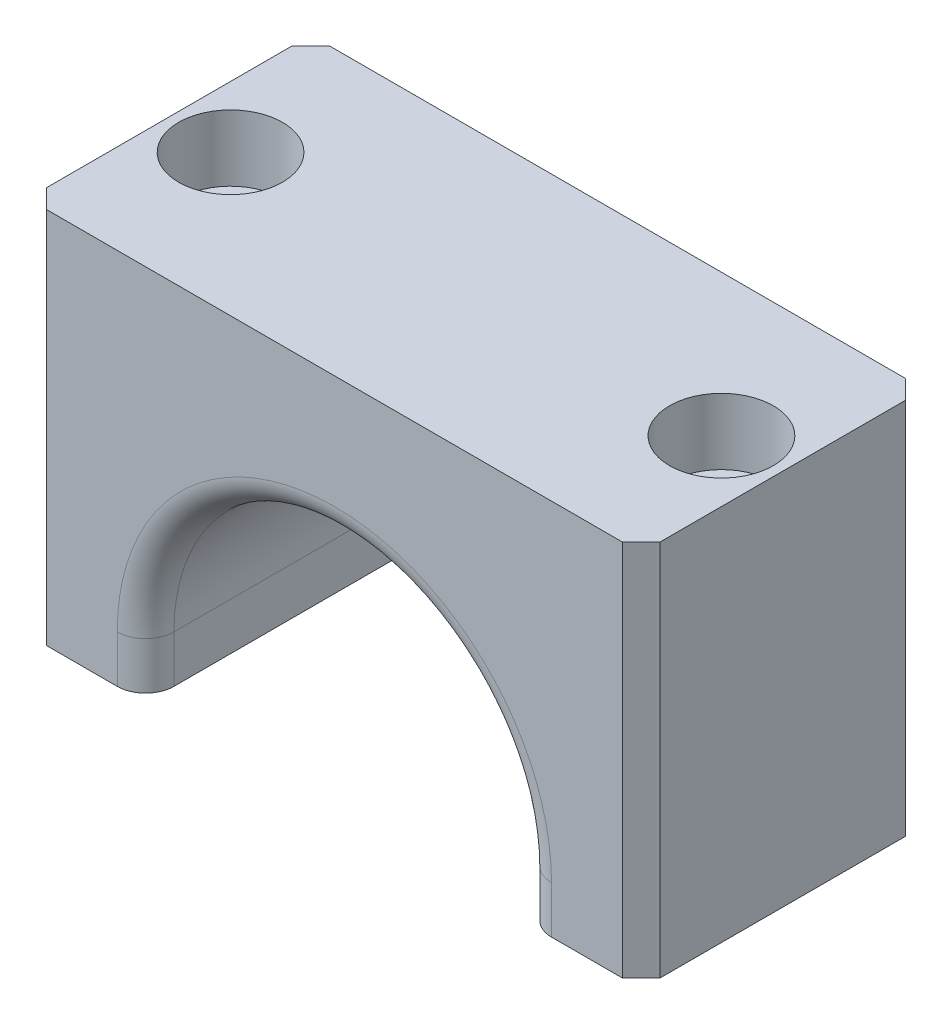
ISO-10303-21;
HEADER;
FILE_DESCRIPTION(('STEP AP214'),'2;1');
FILE_NAME('part.step','',(''),(''),'','','');
FILE_SCHEMA(('AUTOMOTIVE_DESIGN { 1 0 10303 214 1 1 1 1 }'));
ENDSEC;
DATA;
#1=APPLICATION_CONTEXT('core data for automotive mechanical design processes');
#2=APPLICATION_PROTOCOL_DEFINITION('international standard','automotive_design',2000,#1);
#3=PRODUCT_CONTEXT('',#1,'mechanical');
#4=PRODUCT('Part','Part','',(#3));
#5=PRODUCT_RELATED_PRODUCT_CATEGORY('part','',(#4));
#6=PRODUCT_DEFINITION_FORMATION('','',#4);
#7=PRODUCT_DEFINITION_CONTEXT('part definition',#1,'design');
#8=PRODUCT_DEFINITION('design','',#6,#7);
#9=PRODUCT_DEFINITION_SHAPE('','',#8);
#10=(LENGTH_UNIT() NAMED_UNIT(*) SI_UNIT(.MILLI.,.METRE.));
#11=(NAMED_UNIT(*) PLANE_ANGLE_UNIT() SI_UNIT($,.RADIAN.));
#12=(NAMED_UNIT(*) SI_UNIT($,.STERADIAN.) SOLID_ANGLE_UNIT());
#13=UNCERTAINTY_MEASURE_WITH_UNIT(LENGTH_MEASURE(1.E-05),#10,'distance_accuracy_value','');
#14=(GEOMETRIC_REPRESENTATION_CONTEXT(3) GLOBAL_UNCERTAINTY_ASSIGNED_CONTEXT((#13)) GLOBAL_UNIT_ASSIGNED_CONTEXT((#10,
#11,#12)) REPRESENTATION_CONTEXT('',''));
#15=CARTESIAN_POINT('',(0.,0.,0.));
#16=DIRECTION('',(0.,0.,1.));
#17=DIRECTION('',(1.,0.,0.));
#18=AXIS2_PLACEMENT_3D('',#15,#16,#17);
#19=CARTESIAN_POINT('',(-32.5,40.,30.));
#20=DIRECTION('',(1.,0.,0.));
#21=DIRECTION('',(0.,1.,0.));
#22=AXIS2_PLACEMENT_3D('',#19,#20,#21);
#23=PLANE('',#22);
#24=DIRECTION('',(0.,0.,-1.));
#25=VECTOR('',#24,1.);
#26=CARTESIAN_POINT('',(-32.5,40.,30.));
#27=LINE('',#26,#25);
#28=CARTESIAN_POINT('',(-32.5,40.,28.));
#29=VERTEX_POINT('',#28);
#30=CARTESIAN_POINT('',(-32.5,40.,2.));
#31=VERTEX_POINT('',#30);
#32=EDGE_CURVE('E216',#29,#31,#27,.T.);
#33=ORIENTED_EDGE('',*,*,#32,.T.);
#34=DIRECTION('',(0.,-1.,0.));
#35=VECTOR('',#34,1.);
#36=CARTESIAN_POINT('',(-32.5,40.,2.));
#37=LINE('',#36,#35);
#38=CARTESIAN_POINT('',(-32.5,0.,2.));
#39=VERTEX_POINT('',#38);
#40=EDGE_CURVE('E177',#31,#39,#37,.T.);
#41=ORIENTED_EDGE('',*,*,#40,.T.);
#42=DIRECTION('',(0.,0.,-1.));
#43=VECTOR('',#42,1.);
#44=CARTESIAN_POINT('',(-32.5,0.,30.));
#45=LINE('',#44,#43);
#46=CARTESIAN_POINT('',(-32.5,0.,28.));
#47=VERTEX_POINT('',#46);
#48=EDGE_CURVE('E162',#47,#39,#45,.T.);
#49=ORIENTED_EDGE('',*,*,#48,.F.);
#50=DIRECTION('',(0.,1.,0.));
#51=VECTOR('',#50,1.);
#52=CARTESIAN_POINT('',(-32.5,40.,28.));
#53=LINE('',#52,#51);
#54=EDGE_CURVE('E175',#47,#29,#53,.T.);
#55=ORIENTED_EDGE('',*,*,#54,.T.);
#56=EDGE_LOOP('',(#33,#41,#49,#55));
#57=FACE_BOUND('',#56,.T.);
#58=ADVANCED_FACE('F16',(#57),#23,.F.);
#59=CARTESIAN_POINT('',(-32.5,0.,30.));
#60=DIRECTION('',(0.,1.,0.));
#61=DIRECTION('',(0.,0.,1.));
#62=AXIS2_PLACEMENT_3D('',#59,#60,#61);
#63=PLANE('',#62);
#64=CARTESIAN_POINT('',(-26.,0.,15.));
#65=DIRECTION('',(0.,1.,0.));
#66=DIRECTION('',(0.,0.,1.));
#67=AXIS2_PLACEMENT_3D('',#64,#65,#66);
#68=CIRCLE('',#67,3.3);
#69=CARTESIAN_POINT('',(-26.,0.,18.3));
#70=VERTEX_POINT('',#69);
#71=EDGE_CURVE('E274',#70,#70,#68,.T.);
#72=ORIENTED_EDGE('',*,*,#71,.T.);
#73=EDGE_LOOP('',(#72));
#74=FACE_BOUND('',#73,.T.);
#75=ORIENTED_EDGE('',*,*,#48,.T.);
#76=DIRECTION('',(-0.707106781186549,0.,0.707106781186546));
#77=VECTOR('',#76,1.);
#78=CARTESIAN_POINT('',(-32.5,0.,2.));
#79=LINE('',#78,#77);
#80=CARTESIAN_POINT('',(-30.5,0.,0.));
#81=VERTEX_POINT('',#80);
#82=EDGE_CURVE('E182',#39,#81,#79,.F.);
#83=ORIENTED_EDGE('',*,*,#82,.T.);
#84=DIRECTION('',(1.,0.,0.));
#85=VECTOR('',#84,1.);
#86=CARTESIAN_POINT('',(-32.5,0.,0.));
#87=LINE('',#86,#85);
#88=CARTESIAN_POINT('',(-23.,0.,0.));
#89=VERTEX_POINT('',#88);
#90=EDGE_CURVE('E289',#81,#89,#87,.T.);
#91=ORIENTED_EDGE('',*,*,#90,.T.);
#92=CARTESIAN_POINT('',(-23.,0.,3.));
#93=DIRECTION('',(0.,1.,0.));
#94=DIRECTION('',(0.,0.,1.));
#95=AXIS2_PLACEMENT_3D('',#92,#93,#94);
#96=CIRCLE('',#95,3.);
#97=CARTESIAN_POINT('',(-20.,0.,3.));
#98=VERTEX_POINT('',#97);
#99=EDGE_CURVE('E240',#89,#98,#96,.F.);
#100=ORIENTED_EDGE('',*,*,#99,.T.);
#101=DIRECTION('',(0.,0.,-1.));
#102=VECTOR('',#101,1.);
#103=CARTESIAN_POINT('',(-20.,0.,30.));
#104=LINE('',#103,#102);
#105=CARTESIAN_POINT('',(-20.,0.,27.));
#106=VERTEX_POINT('',#105);
#107=EDGE_CURVE('E152',#106,#98,#104,.T.);
#108=ORIENTED_EDGE('',*,*,#107,.F.);
#109=CARTESIAN_POINT('',(-23.,0.,27.));
#110=DIRECTION('',(0.,1.,0.));
#111=DIRECTION('',(0.,0.,1.));
#112=AXIS2_PLACEMENT_3D('',#109,#110,#111);
#113=CIRCLE('',#112,3.);
#114=CARTESIAN_POINT('',(-23.,0.,30.));
#115=VERTEX_POINT('',#114);
#116=EDGE_CURVE('E161',#106,#115,#113,.F.);
#117=ORIENTED_EDGE('',*,*,#116,.T.);
#118=DIRECTION('',(1.,0.,0.));
#119=VECTOR('',#118,1.);
#120=CARTESIAN_POINT('',(-32.5,0.,30.));
#121=LINE('',#120,#119);
#122=CARTESIAN_POINT('',(-30.5,0.,30.));
#123=VERTEX_POINT('',#122);
#124=EDGE_CURVE('E290',#123,#115,#121,.T.);
#125=ORIENTED_EDGE('',*,*,#124,.F.);
#126=DIRECTION('',(-0.707106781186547,0.,-0.707106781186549));
#127=VECTOR('',#126,1.);
#128=CARTESIAN_POINT('',(-30.5,0.,30.));
#129=LINE('',#128,#127);
#130=EDGE_CURVE('E180',#123,#47,#129,.T.);
#131=ORIENTED_EDGE('',*,*,#130,.T.);
#132=EDGE_LOOP('',(#75,#83,#91,#100,#108,#117,#125,#131));
#133=FACE_BOUND('',#132,.T.);
#134=ADVANCED_FACE('F312',(#74,#133),#63,.F.);
#135=CARTESIAN_POINT('',(-20.,0.,30.));
#136=DIRECTION('',(-1.,0.,0.));
#137=DIRECTION('',(0.,0.,1.));
#138=AXIS2_PLACEMENT_3D('',#135,#136,#137);
#139=PLANE('',#138);
#140=ORIENTED_EDGE('',*,*,#107,.T.);
#141=DIRECTION('',(0.,1.,0.));
#142=VECTOR('',#141,1.);
#143=CARTESIAN_POINT('',(-20.,0.,3.));
#144=LINE('',#143,#142);
#145=CARTESIAN_POINT('',(-20.,5.,3.));
#146=VERTEX_POINT('',#145);
#147=EDGE_CURVE('E151',#98,#146,#144,.T.);
#148=ORIENTED_EDGE('',*,*,#147,.T.);
#149=DIRECTION('',(0.,0.,-1.));
#150=VECTOR('',#149,1.);
#151=CARTESIAN_POINT('',(-20.,5.,30.));
#152=LINE('',#151,#150);
#153=CARTESIAN_POINT('',(-20.,5.,27.));
#154=VERTEX_POINT('',#153);
#155=EDGE_CURVE('E133',#154,#146,#152,.T.);
#156=ORIENTED_EDGE('',*,*,#155,.F.);
#157=DIRECTION('',(0.,1.,0.));
#158=VECTOR('',#157,1.);
#159=CARTESIAN_POINT('',(-20.,0.,27.));
#160=LINE('',#159,#158);
#161=EDGE_CURVE('E148',#154,#106,#160,.F.);
#162=ORIENTED_EDGE('',*,*,#161,.T.);
#163=EDGE_LOOP('',(#140,#148,#156,#162));
#164=FACE_BOUND('',#163,.T.);
#165=ADVANCED_FACE('F147',(#164),#139,.F.);
#166=CARTESIAN_POINT('',(0.,5.,30.));
#167=DIRECTION('',(0.,0.,-1.));
#168=DIRECTION('',(-1.,0.,0.));
#169=AXIS2_PLACEMENT_3D('',#166,#167,#168);
#170=CYLINDRICAL_SURFACE('',#169,20.);
#171=ORIENTED_EDGE('',*,*,#155,.T.);
#172=CARTESIAN_POINT('',(0.,5.,3.));
#173=DIRECTION('',(0.,0.,1.));
#174=DIRECTION('',(1.,0.,0.));
#175=AXIS2_PLACEMENT_3D('',#172,#173,#174);
#176=CIRCLE('',#175,20.);
#177=CARTESIAN_POINT('',(20.,5.,3.));
#178=VERTEX_POINT('',#177);
#179=EDGE_CURVE('E140',#146,#178,#176,.F.);
#180=ORIENTED_EDGE('',*,*,#179,.T.);
#181=DIRECTION('',(0.,0.,-1.));
#182=VECTOR('',#181,1.);
#183=CARTESIAN_POINT('',(20.,5.,30.));
#184=LINE('',#183,#182);
#185=CARTESIAN_POINT('',(20.,5.,27.));
#186=VERTEX_POINT('',#185);
#187=EDGE_CURVE('E135',#186,#178,#184,.T.);
#188=ORIENTED_EDGE('',*,*,#187,.F.);
#189=CARTESIAN_POINT('',(0.,5.,27.));
#190=DIRECTION('',(0.,0.,1.));
#191=DIRECTION('',(1.,0.,0.));
#192=AXIS2_PLACEMENT_3D('',#189,#190,#191);
#193=CIRCLE('',#192,20.);
#194=EDGE_CURVE('E130',#186,#154,#193,.T.);
#195=ORIENTED_EDGE('',*,*,#194,.T.);
#196=EDGE_LOOP('',(#171,#180,#188,#195));
#197=FACE_BOUND('',#196,.T.);
#198=ADVANCED_FACE('F132',(#197),#170,.F.);
#199=CARTESIAN_POINT('',(20.,0.,30.));
#200=DIRECTION('',(1.,0.,0.));
#201=DIRECTION('',(0.,0.,-1.));
#202=AXIS2_PLACEMENT_3D('',#199,#200,#201);
#203=PLANE('',#202);
#204=ORIENTED_EDGE('',*,*,#187,.T.);
#205=DIRECTION('',(0.,-1.,0.));
#206=VECTOR('',#205,1.);
#207=CARTESIAN_POINT('',(20.,0.,3.));
#208=LINE('',#207,#206);
#209=CARTESIAN_POINT('',(20.,0.,3.));
#210=VERTEX_POINT('',#209);
#211=EDGE_CURVE('E244',#178,#210,#208,.T.);
#212=ORIENTED_EDGE('',*,*,#211,.T.);
#213=DIRECTION('',(0.,0.,-1.));
#214=VECTOR('',#213,1.);
#215=CARTESIAN_POINT('',(20.,0.,30.));
#216=LINE('',#215,#214);
#217=CARTESIAN_POINT('',(20.,0.,27.));
#218=VERTEX_POINT('',#217);
#219=EDGE_CURVE('E218',#218,#210,#216,.T.);
#220=ORIENTED_EDGE('',*,*,#219,.F.);
#221=DIRECTION('',(0.,-1.,0.));
#222=VECTOR('',#221,1.);
#223=CARTESIAN_POINT('',(20.,5.,27.));
#224=LINE('',#223,#222);
#225=EDGE_CURVE('E242',#218,#186,#224,.F.);
#226=ORIENTED_EDGE('',*,*,#225,.T.);
#227=EDGE_LOOP('',(#204,#212,#220,#226));
#228=FACE_BOUND('',#227,.T.);
#229=ADVANCED_FACE('F334',(#228),#203,.F.);
#230=CARTESIAN_POINT('',(20.,0.,30.));
#231=DIRECTION('',(0.,1.,0.));
#232=DIRECTION('',(0.,0.,1.));
#233=AXIS2_PLACEMENT_3D('',#230,#231,#232);
#234=PLANE('',#233);
#235=CARTESIAN_POINT('',(26.,0.,15.));
#236=DIRECTION('',(0.,1.,0.));
#237=DIRECTION('',(0.,0.,1.));
#238=AXIS2_PLACEMENT_3D('',#235,#236,#237);
#239=CIRCLE('',#238,3.3);
#240=CARTESIAN_POINT('',(26.,0.,18.3));
#241=VERTEX_POINT('',#240);
#242=EDGE_CURVE('E286',#241,#241,#239,.T.);
#243=ORIENTED_EDGE('',*,*,#242,.T.);
#244=EDGE_LOOP('',(#243));
#245=FACE_BOUND('',#244,.T.);
#246=DIRECTION('',(0.,0.,-1.));
#247=VECTOR('',#246,1.);
#248=CARTESIAN_POINT('',(32.5,0.,30.));
#249=LINE('',#248,#247);
#250=CARTESIAN_POINT('',(32.5,0.,28.));
#251=VERTEX_POINT('',#250);
#252=CARTESIAN_POINT('',(32.5,0.,2.));
#253=VERTEX_POINT('',#252);
#254=EDGE_CURVE('E209',#251,#253,#249,.T.);
#255=ORIENTED_EDGE('',*,*,#254,.F.);
#256=DIRECTION('',(-0.707106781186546,0.,0.707106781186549));
#257=VECTOR('',#256,1.);
#258=CARTESIAN_POINT('',(30.5,0.,30.));
#259=LINE('',#258,#257);
#260=CARTESIAN_POINT('',(30.5,0.,30.));
#261=VERTEX_POINT('',#260);
#262=EDGE_CURVE('E11',#251,#261,#259,.T.);
#263=ORIENTED_EDGE('',*,*,#262,.T.);
#264=DIRECTION('',(1.,0.,0.));
#265=VECTOR('',#264,1.);
#266=CARTESIAN_POINT('',(20.,0.,30.));
#267=LINE('',#266,#265);
#268=CARTESIAN_POINT('',(23.,0.,30.));
#269=VERTEX_POINT('',#268);
#270=EDGE_CURVE('E292',#269,#261,#267,.T.);
#271=ORIENTED_EDGE('',*,*,#270,.F.);
#272=CARTESIAN_POINT('',(23.,0.,27.));
#273=DIRECTION('',(0.,1.,0.));
#274=DIRECTION('',(0.,0.,1.));
#275=AXIS2_PLACEMENT_3D('',#272,#273,#274);
#276=CIRCLE('',#275,3.);
#277=EDGE_CURVE('E246',#269,#218,#276,.F.);
#278=ORIENTED_EDGE('',*,*,#277,.T.);
#279=ORIENTED_EDGE('',*,*,#219,.T.);
#280=CARTESIAN_POINT('',(23.,0.,3.));
#281=DIRECTION('',(0.,1.,0.));
#282=DIRECTION('',(0.,0.,1.));
#283=AXIS2_PLACEMENT_3D('',#280,#281,#282);
#284=CIRCLE('',#283,3.);
#285=CARTESIAN_POINT('',(23.,0.,0.));
#286=VERTEX_POINT('',#285);
#287=EDGE_CURVE('E248',#210,#286,#284,.F.);
#288=ORIENTED_EDGE('',*,*,#287,.T.);
#289=DIRECTION('',(1.,0.,0.));
#290=VECTOR('',#289,1.);
#291=CARTESIAN_POINT('',(20.,0.,0.));
#292=LINE('',#291,#290);
#293=CARTESIAN_POINT('',(30.5,0.,0.));
#294=VERTEX_POINT('',#293);
#295=EDGE_CURVE('E299',#286,#294,#292,.T.);
#296=ORIENTED_EDGE('',*,*,#295,.T.);
#297=DIRECTION('',(-0.707106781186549,0.,-0.707106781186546));
#298=VECTOR('',#297,1.);
#299=CARTESIAN_POINT('',(32.5,0.,2.));
#300=LINE('',#299,#298);
#301=EDGE_CURVE('E24',#294,#253,#300,.F.);
#302=ORIENTED_EDGE('',*,*,#301,.T.);
#303=EDGE_LOOP('',(#255,#263,#271,#278,#279,#288,#296,#302));
#304=FACE_BOUND('',#303,.T.);
#305=ADVANCED_FACE('F326',(#245,#304),#234,.F.);
#306=CARTESIAN_POINT('',(32.5,40.,30.));
#307=DIRECTION('',(-1.,0.,0.));
#308=DIRECTION('',(0.,0.,1.));
#309=AXIS2_PLACEMENT_3D('',#306,#307,#308);
#310=PLANE('',#309);
#311=DIRECTION('',(0.,0.,-1.));
#312=VECTOR('',#311,1.);
#313=CARTESIAN_POINT('',(32.5,40.,30.));
#314=LINE('',#313,#312);
#315=CARTESIAN_POINT('',(32.5,40.,28.));
#316=VERTEX_POINT('',#315);
#317=CARTESIAN_POINT('',(32.5,40.,2.));
#318=VERTEX_POINT('',#317);
#319=EDGE_CURVE('E208',#316,#318,#314,.T.);
#320=ORIENTED_EDGE('',*,*,#319,.F.);
#321=DIRECTION('',(0.,-1.,0.));
#322=VECTOR('',#321,1.);
#323=CARTESIAN_POINT('',(32.5,0.,28.));
#324=LINE('',#323,#322);
#325=EDGE_CURVE('E37',#316,#251,#324,.T.);
#326=ORIENTED_EDGE('',*,*,#325,.T.);
#327=ORIENTED_EDGE('',*,*,#254,.T.);
#328=DIRECTION('',(0.,1.,0.));
#329=VECTOR('',#328,1.);
#330=CARTESIAN_POINT('',(32.5,40.,2.));
#331=LINE('',#330,#329);
#332=EDGE_CURVE('E202',#253,#318,#331,.T.);
#333=ORIENTED_EDGE('',*,*,#332,.T.);
#334=EDGE_LOOP('',(#320,#326,#327,#333));
#335=FACE_BOUND('',#334,.T.);
#336=ADVANCED_FACE('F207',(#335),#310,.F.);
#337=CARTESIAN_POINT('',(-32.5,40.,30.));
#338=DIRECTION('',(0.,-1.,0.));
#339=DIRECTION('',(0.,0.,-1.));
#340=AXIS2_PLACEMENT_3D('',#337,#338,#339);
#341=PLANE('',#340);
#342=CARTESIAN_POINT('',(-26.,40.,15.));
#343=DIRECTION('',(0.,1.,0.));
#344=DIRECTION('',(0.,0.,1.));
#345=AXIS2_PLACEMENT_3D('',#342,#343,#344);
#346=CIRCLE('',#345,5.5);
#347=CARTESIAN_POINT('',(-26.,40.,20.5));
#348=VERTEX_POINT('',#347);
#349=EDGE_CURVE('E259',#348,#348,#346,.T.);
#350=ORIENTED_EDGE('',*,*,#349,.F.);
#351=EDGE_LOOP('',(#350));
#352=FACE_BOUND('',#351,.T.);
#353=CARTESIAN_POINT('',(26.,40.,15.));
#354=DIRECTION('',(0.,1.,0.));
#355=DIRECTION('',(0.,0.,1.));
#356=AXIS2_PLACEMENT_3D('',#353,#354,#355);
#357=CIRCLE('',#356,5.5);
#358=CARTESIAN_POINT('',(26.,40.,20.5));
#359=VERTEX_POINT('',#358);
#360=EDGE_CURVE('E277',#359,#359,#357,.T.);
#361=ORIENTED_EDGE('',*,*,#360,.F.);
#362=EDGE_LOOP('',(#361));
#363=FACE_BOUND('',#362,.T.);
#364=DIRECTION('',(-1.,0.,0.));
#365=VECTOR('',#364,1.);
#366=CARTESIAN_POINT('',(-32.5,40.,0.));
#367=LINE('',#366,#365);
#368=CARTESIAN_POINT('',(30.5,40.,0.));
#369=VERTEX_POINT('',#368);
#370=CARTESIAN_POINT('',(-30.5,40.,0.));
#371=VERTEX_POINT('',#370);
#372=EDGE_CURVE('E293',#369,#371,#367,.T.);
#373=ORIENTED_EDGE('',*,*,#372,.T.);
#374=DIRECTION('',(0.707106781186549,0.,-0.707106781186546));
#375=VECTOR('',#374,1.);
#376=CARTESIAN_POINT('',(-32.5,40.,2.));
#377=LINE('',#376,#375);
#378=EDGE_CURVE('E194',#371,#31,#377,.F.);
#379=ORIENTED_EDGE('',*,*,#378,.T.);
#380=ORIENTED_EDGE('',*,*,#32,.F.);
#381=DIRECTION('',(0.707106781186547,0.,0.707106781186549));
#382=VECTOR('',#381,1.);
#383=CARTESIAN_POINT('',(-30.5,40.,30.));
#384=LINE('',#383,#382);
#385=CARTESIAN_POINT('',(-30.5,40.,30.));
#386=VERTEX_POINT('',#385);
#387=EDGE_CURVE('E192',#29,#386,#384,.T.);
#388=ORIENTED_EDGE('',*,*,#387,.T.);
#389=DIRECTION('',(-1.,0.,0.));
#390=VECTOR('',#389,1.);
#391=CARTESIAN_POINT('',(-32.5,40.,30.));
#392=LINE('',#391,#390);
#393=CARTESIAN_POINT('',(30.5,40.,30.));
#394=VERTEX_POINT('',#393);
#395=EDGE_CURVE('E221',#394,#386,#392,.T.);
#396=ORIENTED_EDGE('',*,*,#395,.F.);
#397=DIRECTION('',(0.707106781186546,0.,-0.707106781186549));
#398=VECTOR('',#397,1.);
#399=CARTESIAN_POINT('',(30.5,40.,30.));
#400=LINE('',#399,#398);
#401=EDGE_CURVE('E190',#394,#316,#400,.T.);
#402=ORIENTED_EDGE('',*,*,#401,.T.);
#403=ORIENTED_EDGE('',*,*,#319,.T.);
#404=DIRECTION('',(0.707106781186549,0.,0.707106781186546));
#405=VECTOR('',#404,1.);
#406=CARTESIAN_POINT('',(32.5,40.,2.));
#407=LINE('',#406,#405);
#408=EDGE_CURVE('E188',#318,#369,#407,.F.);
#409=ORIENTED_EDGE('',*,*,#408,.T.);
#410=EDGE_LOOP('',(#373,#379,#380,#388,#396,#402,#403,#409));
#411=FACE_BOUND('',#410,.T.);
#412=ADVANCED_FACE('F213',(#352,#363,#411),#341,.F.);
#413=CARTESIAN_POINT('',(0.,5.,30.));
#414=DIRECTION('',(0.,0.,1.));
#415=DIRECTION('',(1.,0.,0.));
#416=AXIS2_PLACEMENT_3D('',#413,#414,#415);
#417=PLANE('',#416);
#418=ORIENTED_EDGE('',*,*,#395,.T.);
#419=DIRECTION('',(0.,-1.,0.));
#420=VECTOR('',#419,1.);
#421=CARTESIAN_POINT('',(-30.5,0.,30.));
#422=LINE('',#421,#420);
#423=EDGE_CURVE('E199',#386,#123,#422,.T.);
#424=ORIENTED_EDGE('',*,*,#423,.T.);
#425=ORIENTED_EDGE('',*,*,#124,.T.);
#426=DIRECTION('',(0.,1.,0.));
#427=VECTOR('',#426,1.);
#428=CARTESIAN_POINT('',(-23.,5.,30.));
#429=LINE('',#428,#427);
#430=CARTESIAN_POINT('',(-23.,5.,30.));
#431=VERTEX_POINT('',#430);
#432=EDGE_CURVE('E141',#115,#431,#429,.T.);
#433=ORIENTED_EDGE('',*,*,#432,.T.);
#434=CARTESIAN_POINT('',(0.,5.,30.));
#435=DIRECTION('',(0.,0.,1.));
#436=DIRECTION('',(1.,0.,0.));
#437=AXIS2_PLACEMENT_3D('',#434,#435,#436);
#438=CIRCLE('',#437,23.);
#439=CARTESIAN_POINT('',(23.,5.,30.));
#440=VERTEX_POINT('',#439);
#441=EDGE_CURVE('E165',#431,#440,#438,.F.);
#442=ORIENTED_EDGE('',*,*,#441,.T.);
#443=DIRECTION('',(0.,-1.,0.));
#444=VECTOR('',#443,1.);
#445=CARTESIAN_POINT('',(23.,0.,30.));
#446=LINE('',#445,#444);
#447=EDGE_CURVE('E251',#440,#269,#446,.T.);
#448=ORIENTED_EDGE('',*,*,#447,.T.);
#449=ORIENTED_EDGE('',*,*,#270,.T.);
#450=DIRECTION('',(0.,1.,0.));
#451=VECTOR('',#450,1.);
#452=CARTESIAN_POINT('',(30.5,40.,30.));
#453=LINE('',#452,#451);
#454=EDGE_CURVE('E196',#261,#394,#453,.T.);
#455=ORIENTED_EDGE('',*,*,#454,.T.);
#456=EDGE_LOOP('',(#418,#424,#425,#433,#442,#448,#449,#455));
#457=FACE_BOUND('',#456,.T.);
#458=ADVANCED_FACE('F320',(#457),#417,.T.);
#459=CARTESIAN_POINT('',(0.,5.,0.));
#460=DIRECTION('',(0.,0.,1.));
#461=DIRECTION('',(1.,0.,0.));
#462=AXIS2_PLACEMENT_3D('',#459,#460,#461);
#463=PLANE('',#462);
#464=ORIENTED_EDGE('',*,*,#90,.F.);
#465=DIRECTION('',(0.,1.,0.));
#466=VECTOR('',#465,1.);
#467=CARTESIAN_POINT('',(-30.5,5.,0.));
#468=LINE('',#467,#466);
#469=EDGE_CURVE('E186',#81,#371,#468,.T.);
#470=ORIENTED_EDGE('',*,*,#469,.T.);
#471=ORIENTED_EDGE('',*,*,#372,.F.);
#472=DIRECTION('',(0.,-1.,0.));
#473=VECTOR('',#472,1.);
#474=CARTESIAN_POINT('',(30.5,5.,0.));
#475=LINE('',#474,#473);
#476=EDGE_CURVE('E184',#369,#294,#475,.T.);
#477=ORIENTED_EDGE('',*,*,#476,.T.);
#478=ORIENTED_EDGE('',*,*,#295,.F.);
#479=DIRECTION('',(0.,-1.,0.));
#480=VECTOR('',#479,1.);
#481=CARTESIAN_POINT('',(23.,5.,0.));
#482=LINE('',#481,#480);
#483=CARTESIAN_POINT('',(23.,5.,0.));
#484=VERTEX_POINT('',#483);
#485=EDGE_CURVE('E234',#286,#484,#482,.F.);
#486=ORIENTED_EDGE('',*,*,#485,.T.);
#487=CARTESIAN_POINT('',(0.,5.,0.));
#488=DIRECTION('',(0.,0.,1.));
#489=DIRECTION('',(1.,0.,0.));
#490=AXIS2_PLACEMENT_3D('',#487,#488,#489);
#491=CIRCLE('',#490,23.);
#492=CARTESIAN_POINT('',(-23.,5.,0.));
#493=VERTEX_POINT('',#492);
#494=EDGE_CURVE('E232',#484,#493,#491,.T.);
#495=ORIENTED_EDGE('',*,*,#494,.T.);
#496=DIRECTION('',(0.,1.,0.));
#497=VECTOR('',#496,1.);
#498=CARTESIAN_POINT('',(-23.,5.,0.));
#499=LINE('',#498,#497);
#500=EDGE_CURVE('E236',#493,#89,#499,.F.);
#501=ORIENTED_EDGE('',*,*,#500,.T.);
#502=EDGE_LOOP('',(#464,#470,#471,#477,#478,#486,#495,#501));
#503=FACE_BOUND('',#502,.T.);
#504=ADVANCED_FACE('F341',(#503),#463,.F.);
#505=CARTESIAN_POINT('',(26.,40.,15.));
#506=DIRECTION('',(0.,1.,0.));
#507=DIRECTION('',(0.,0.,1.));
#508=AXIS2_PLACEMENT_3D('',#505,#506,#507);
#509=CYLINDRICAL_SURFACE('',#508,3.3);
#510=ORIENTED_EDGE('',*,*,#242,.F.);
#511=EDGE_LOOP('',(#510));
#512=FACE_BOUND('',#511,.T.);
#513=CARTESIAN_POINT('',(26.,33.,15.));
#514=DIRECTION('',(0.,1.,0.));
#515=DIRECTION('',(0.,0.,1.));
#516=AXIS2_PLACEMENT_3D('',#513,#514,#515);
#517=CIRCLE('',#516,3.3);
#518=CARTESIAN_POINT('',(26.,33.,18.3));
#519=VERTEX_POINT('',#518);
#520=EDGE_CURVE('E283',#519,#519,#517,.T.);
#521=ORIENTED_EDGE('',*,*,#520,.T.);
#522=EDGE_LOOP('',(#521));
#523=FACE_BOUND('',#522,.T.);
#524=ADVANCED_FACE('F463',(#512,#523),#509,.F.);
#525=CARTESIAN_POINT('',(29.3,33.,15.));
#526=DIRECTION('',(0.,-1.,0.));
#527=DIRECTION('',(0.,0.,-1.));
#528=AXIS2_PLACEMENT_3D('',#525,#526,#527);
#529=PLANE('',#528);
#530=ORIENTED_EDGE('',*,*,#520,.F.);
#531=EDGE_LOOP('',(#530));
#532=FACE_BOUND('',#531,.T.);
#533=CARTESIAN_POINT('',(26.,33.,15.));
#534=DIRECTION('',(0.,1.,0.));
#535=DIRECTION('',(0.,0.,1.));
#536=AXIS2_PLACEMENT_3D('',#533,#534,#535);
#537=CIRCLE('',#536,5.5);
#538=CARTESIAN_POINT('',(26.,33.,20.5));
#539=VERTEX_POINT('',#538);
#540=EDGE_CURVE('E280',#539,#539,#537,.T.);
#541=ORIENTED_EDGE('',*,*,#540,.T.);
#542=EDGE_LOOP('',(#541));
#543=FACE_BOUND('',#542,.T.);
#544=ADVANCED_FACE('F455',(#532,#543),#529,.F.);
#545=CARTESIAN_POINT('',(26.,40.,15.));
#546=DIRECTION('',(0.,1.,0.));
#547=DIRECTION('',(0.,0.,1.));
#548=AXIS2_PLACEMENT_3D('',#545,#546,#547);
#549=CYLINDRICAL_SURFACE('',#548,5.5);
#550=ORIENTED_EDGE('',*,*,#540,.F.);
#551=EDGE_LOOP('',(#550));
#552=FACE_BOUND('',#551,.T.);
#553=ORIENTED_EDGE('',*,*,#360,.T.);
#554=EDGE_LOOP('',(#553));
#555=FACE_BOUND('',#554,.T.);
#556=ADVANCED_FACE('F447',(#552,#555),#549,.F.);
#557=CARTESIAN_POINT('',(-26.,40.,15.));
#558=DIRECTION('',(0.,1.,0.));
#559=DIRECTION('',(0.,0.,1.));
#560=AXIS2_PLACEMENT_3D('',#557,#558,#559);
#561=CYLINDRICAL_SURFACE('',#560,3.3);
#562=ORIENTED_EDGE('',*,*,#71,.F.);
#563=EDGE_LOOP('',(#562));
#564=FACE_BOUND('',#563,.T.);
#565=CARTESIAN_POINT('',(-26.,33.,15.));
#566=DIRECTION('',(0.,1.,0.));
#567=DIRECTION('',(0.,0.,1.));
#568=AXIS2_PLACEMENT_3D('',#565,#566,#567);
#569=CIRCLE('',#568,3.3);
#570=CARTESIAN_POINT('',(-26.,33.,18.3));
#571=VERTEX_POINT('',#570);
#572=EDGE_CURVE('E269',#571,#571,#569,.T.);
#573=ORIENTED_EDGE('',*,*,#572,.T.);
#574=EDGE_LOOP('',(#573));
#575=FACE_BOUND('',#574,.T.);
#576=ADVANCED_FACE('F439',(#564,#575),#561,.F.);
#577=CARTESIAN_POINT('',(-22.7,33.,15.));
#578=DIRECTION('',(0.,-1.,0.));
#579=DIRECTION('',(0.,0.,-1.));
#580=AXIS2_PLACEMENT_3D('',#577,#578,#579);
#581=PLANE('',#580);
#582=ORIENTED_EDGE('',*,*,#572,.F.);
#583=EDGE_LOOP('',(#582));
#584=FACE_BOUND('',#583,.T.);
#585=CARTESIAN_POINT('',(-26.,33.,15.));
#586=DIRECTION('',(0.,1.,0.));
#587=DIRECTION('',(0.,0.,1.));
#588=AXIS2_PLACEMENT_3D('',#585,#586,#587);
#589=CIRCLE('',#588,5.5);
#590=CARTESIAN_POINT('',(-26.,33.,20.5));
#591=VERTEX_POINT('',#590);
#592=EDGE_CURVE('E264',#591,#591,#589,.T.);
#593=ORIENTED_EDGE('',*,*,#592,.T.);
#594=EDGE_LOOP('',(#593));
#595=FACE_BOUND('',#594,.T.);
#596=ADVANCED_FACE('F430',(#584,#595),#581,.F.);
#597=CARTESIAN_POINT('',(-26.,40.,15.));
#598=DIRECTION('',(0.,1.,0.));
#599=DIRECTION('',(0.,0.,1.));
#600=AXIS2_PLACEMENT_3D('',#597,#598,#599);
#601=CYLINDRICAL_SURFACE('',#600,5.5);
#602=ORIENTED_EDGE('',*,*,#592,.F.);
#603=EDGE_LOOP('',(#602));
#604=FACE_BOUND('',#603,.T.);
#605=ORIENTED_EDGE('',*,*,#349,.T.);
#606=EDGE_LOOP('',(#605));
#607=FACE_BOUND('',#606,.T.);
#608=ADVANCED_FACE('F366',(#604,#607),#601,.F.);
#609=CARTESIAN_POINT('',(23.,0.,3.));
#610=DIRECTION('',(0.,-1.,0.));
#611=DIRECTION('',(0.,0.,-1.));
#612=AXIS2_PLACEMENT_3D('',#609,#610,#611);
#613=CYLINDRICAL_SURFACE('',#612,3.);
#614=ORIENTED_EDGE('',*,*,#287,.F.);
#615=ORIENTED_EDGE('',*,*,#211,.F.);
#616=CARTESIAN_POINT('',(23.,5.,3.));
#617=DIRECTION('',(0.,1.,0.));
#618=DIRECTION('',(0.,0.,1.));
#619=AXIS2_PLACEMENT_3D('',#616,#617,#618);
#620=CIRCLE('',#619,3.);
#621=EDGE_CURVE('E172',#484,#178,#620,.T.);
#622=ORIENTED_EDGE('',*,*,#621,.F.);
#623=ORIENTED_EDGE('',*,*,#485,.F.);
#624=EDGE_LOOP('',(#614,#615,#622,#623));
#625=FACE_BOUND('',#624,.T.);
#626=ADVANCED_FACE('F340',(#625),#613,.T.);
#627=CARTESIAN_POINT('',(0.,5.,3.));
#628=DIRECTION('',(0.,0.,1.));
#629=DIRECTION('',(1.,0.,0.));
#630=AXIS2_PLACEMENT_3D('',#627,#628,#629);
#631=TOROIDAL_SURFACE('',#630,23.,3.);
#632=ORIENTED_EDGE('',*,*,#621,.T.);
#633=ORIENTED_EDGE('',*,*,#179,.F.);
#634=CARTESIAN_POINT('',(-23.,5.,3.));
#635=DIRECTION('',(0.,-1.,0.));
#636=DIRECTION('',(0.,0.,-1.));
#637=AXIS2_PLACEMENT_3D('',#634,#635,#636);
#638=CIRCLE('',#637,3.);
#639=EDGE_CURVE('E169',#493,#146,#638,.T.);
#640=ORIENTED_EDGE('',*,*,#639,.F.);
#641=ORIENTED_EDGE('',*,*,#494,.F.);
#642=EDGE_LOOP('',(#632,#633,#640,#641));
#643=FACE_BOUND('',#642,.T.);
#644=ADVANCED_FACE('F361',(#643),#631,.T.);
#645=CARTESIAN_POINT('',(-23.,0.,3.));
#646=DIRECTION('',(0.,1.,0.));
#647=DIRECTION('',(0.,0.,1.));
#648=AXIS2_PLACEMENT_3D('',#645,#646,#647);
#649=CYLINDRICAL_SURFACE('',#648,3.);
#650=ORIENTED_EDGE('',*,*,#99,.F.);
#651=ORIENTED_EDGE('',*,*,#500,.F.);
#652=ORIENTED_EDGE('',*,*,#639,.T.);
#653=ORIENTED_EDGE('',*,*,#147,.F.);
#654=EDGE_LOOP('',(#650,#651,#652,#653));
#655=FACE_BOUND('',#654,.T.);
#656=ADVANCED_FACE('F358',(#655),#649,.T.);
#657=CARTESIAN_POINT('',(23.,5.,27.));
#658=DIRECTION('',(0.,1.,0.));
#659=DIRECTION('',(0.,0.,1.));
#660=AXIS2_PLACEMENT_3D('',#657,#658,#659);
#661=CYLINDRICAL_SURFACE('',#660,3.);
#662=ORIENTED_EDGE('',*,*,#277,.F.);
#663=ORIENTED_EDGE('',*,*,#447,.F.);
#664=CARTESIAN_POINT('',(23.,5.,27.));
#665=DIRECTION('',(0.,1.,0.));
#666=DIRECTION('',(0.,0.,1.));
#667=AXIS2_PLACEMENT_3D('',#664,#665,#666);
#668=CIRCLE('',#667,3.);
#669=EDGE_CURVE('E167',#186,#440,#668,.T.);
#670=ORIENTED_EDGE('',*,*,#669,.F.);
#671=ORIENTED_EDGE('',*,*,#225,.F.);
#672=EDGE_LOOP('',(#662,#663,#670,#671));
#673=FACE_BOUND('',#672,.T.);
#674=ADVANCED_FACE('F332',(#673),#661,.T.);
#675=CARTESIAN_POINT('',(0.,5.,27.));
#676=DIRECTION('',(0.,0.,1.));
#677=DIRECTION('',(1.,0.,0.));
#678=AXIS2_PLACEMENT_3D('',#675,#676,#677);
#679=TOROIDAL_SURFACE('',#678,23.,3.);
#680=ORIENTED_EDGE('',*,*,#669,.T.);
#681=ORIENTED_EDGE('',*,*,#441,.F.);
#682=CARTESIAN_POINT('',(-23.,5.,27.));
#683=DIRECTION('',(0.,-1.,0.));
#684=DIRECTION('',(0.,0.,-1.));
#685=AXIS2_PLACEMENT_3D('',#682,#683,#684);
#686=CIRCLE('',#685,3.);
#687=EDGE_CURVE('E158',#154,#431,#686,.T.);
#688=ORIENTED_EDGE('',*,*,#687,.F.);
#689=ORIENTED_EDGE('',*,*,#194,.F.);
#690=EDGE_LOOP('',(#680,#681,#688,#689));
#691=FACE_BOUND('',#690,.T.);
#692=ADVANCED_FACE('F164',(#691),#679,.T.);
#693=CARTESIAN_POINT('',(-23.,5.,27.));
#694=DIRECTION('',(0.,-1.,0.));
#695=DIRECTION('',(0.,0.,-1.));
#696=AXIS2_PLACEMENT_3D('',#693,#694,#695);
#697=CYLINDRICAL_SURFACE('',#696,3.);
#698=ORIENTED_EDGE('',*,*,#116,.F.);
#699=ORIENTED_EDGE('',*,*,#161,.F.);
#700=ORIENTED_EDGE('',*,*,#687,.T.);
#701=ORIENTED_EDGE('',*,*,#432,.F.);
#702=EDGE_LOOP('',(#698,#699,#700,#701));
#703=FACE_BOUND('',#702,.T.);
#704=ADVANCED_FACE('F156',(#703),#697,.T.);
#705=CARTESIAN_POINT('',(-32.5,40.,2.));
#706=DIRECTION('',(0.707106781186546,0.,0.707106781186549));
#707=DIRECTION('',(0.707106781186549,0.,-0.707106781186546));
#708=AXIS2_PLACEMENT_3D('',#705,#706,#707);
#709=PLANE('',#708);
#710=ORIENTED_EDGE('',*,*,#378,.F.);
#711=ORIENTED_EDGE('',*,*,#469,.F.);
#712=ORIENTED_EDGE('',*,*,#82,.F.);
#713=ORIENTED_EDGE('',*,*,#40,.F.);
#714=EDGE_LOOP('',(#710,#711,#712,#713));
#715=FACE_BOUND('',#714,.T.);
#716=ADVANCED_FACE('F307',(#715),#709,.F.);
#717=CARTESIAN_POINT('',(-30.5,5.,30.));
#718=DIRECTION('',(-0.707106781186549,0.,0.707106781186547));
#719=DIRECTION('',(0.707106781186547,0.,0.707106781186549));
#720=AXIS2_PLACEMENT_3D('',#717,#718,#719);
#721=PLANE('',#720);
#722=ORIENTED_EDGE('',*,*,#387,.F.);
#723=ORIENTED_EDGE('',*,*,#54,.F.);
#724=ORIENTED_EDGE('',*,*,#130,.F.);
#725=ORIENTED_EDGE('',*,*,#423,.F.);
#726=EDGE_LOOP('',(#722,#723,#724,#725));
#727=FACE_BOUND('',#726,.T.);
#728=ADVANCED_FACE('F318',(#727),#721,.T.);
#729=CARTESIAN_POINT('',(30.5,5.,30.));
#730=DIRECTION('',(0.707106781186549,0.,0.707106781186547));
#731=DIRECTION('',(0.707106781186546,0.,-0.707106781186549));
#732=AXIS2_PLACEMENT_3D('',#729,#730,#731);
#733=PLANE('',#732);
#734=ORIENTED_EDGE('',*,*,#262,.F.);
#735=ORIENTED_EDGE('',*,*,#325,.F.);
#736=ORIENTED_EDGE('',*,*,#401,.F.);
#737=ORIENTED_EDGE('',*,*,#454,.F.);
#738=EDGE_LOOP('',(#734,#735,#736,#737));
#739=FACE_BOUND('',#738,.T.);
#740=ADVANCED_FACE('F325',(#739),#733,.T.);
#741=CARTESIAN_POINT('',(32.5,40.,2.));
#742=DIRECTION('',(-0.707106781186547,0.,0.707106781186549));
#743=DIRECTION('',(0.707106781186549,0.,0.707106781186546));
#744=AXIS2_PLACEMENT_3D('',#741,#742,#743);
#745=PLANE('',#744);
#746=ORIENTED_EDGE('',*,*,#301,.F.);
#747=ORIENTED_EDGE('',*,*,#476,.F.);
#748=ORIENTED_EDGE('',*,*,#408,.F.);
#749=ORIENTED_EDGE('',*,*,#332,.F.);
#750=EDGE_LOOP('',(#746,#747,#748,#749));
#751=FACE_BOUND('',#750,.T.);
#752=ADVANCED_FACE('F18',(#751),#745,.F.);
#753=CLOSED_SHELL('',(#58,#134,#165,#198,#229,#305,#336,#412,#458,#504,#524,#544,#556,#576,#596,
#608,#626,#644,#656,#674,#692,#704,#716,#728,#740,#752));
#754=MANIFOLD_SOLID_BREP('B1',#753);
#755=ADVANCED_BREP_SHAPE_REPRESENTATION('',(#18,#754),#14);
#756=SHAPE_DEFINITION_REPRESENTATION(#9,#755);
ENDSEC;
END-ISO-10303-21;
